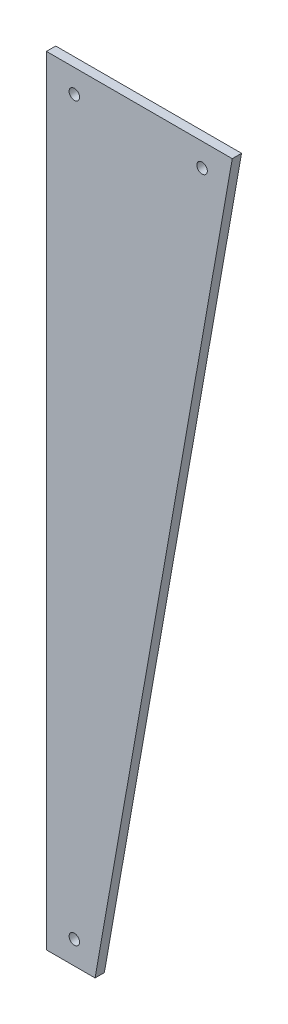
ISO-10303-21;
HEADER;
FILE_DESCRIPTION(('STEP AP214'),'2;1');
FILE_NAME('part.step','',(''),(''),'','','');
FILE_SCHEMA(('AUTOMOTIVE_DESIGN { 1 0 10303 214 1 1 1 1 }'));
ENDSEC;
DATA;
#1=APPLICATION_CONTEXT('core data for automotive mechanical design processes');
#2=APPLICATION_PROTOCOL_DEFINITION('international standard','automotive_design',2000,#1);
#3=PRODUCT_CONTEXT('',#1,'mechanical');
#4=PRODUCT('Part','Part','',(#3));
#5=PRODUCT_RELATED_PRODUCT_CATEGORY('part','',(#4));
#6=PRODUCT_DEFINITION_FORMATION('','',#4);
#7=PRODUCT_DEFINITION_CONTEXT('part definition',#1,'design');
#8=PRODUCT_DEFINITION('design','',#6,#7);
#9=PRODUCT_DEFINITION_SHAPE('','',#8);
#10=(LENGTH_UNIT() NAMED_UNIT(*) SI_UNIT(.MILLI.,.METRE.));
#11=(NAMED_UNIT(*) PLANE_ANGLE_UNIT() SI_UNIT($,.RADIAN.));
#12=(NAMED_UNIT(*) SI_UNIT($,.STERADIAN.) SOLID_ANGLE_UNIT());
#13=UNCERTAINTY_MEASURE_WITH_UNIT(LENGTH_MEASURE(1.E-05),#10,'distance_accuracy_value','');
#14=(GEOMETRIC_REPRESENTATION_CONTEXT(3) GLOBAL_UNCERTAINTY_ASSIGNED_CONTEXT((#13)) GLOBAL_UNIT_ASSIGNED_CONTEXT((#10,
#11,#12)) REPRESENTATION_CONTEXT('',''));
#15=CARTESIAN_POINT('',(0.,0.,0.));
#16=DIRECTION('',(0.,0.,1.));
#17=DIRECTION('',(1.,0.,0.));
#18=AXIS2_PLACEMENT_3D('',#15,#16,#17);
#19=CARTESIAN_POINT('',(0.,0.,4.));
#20=DIRECTION('',(0.,0.,1.));
#21=DIRECTION('',(1.,0.,0.));
#22=AXIS2_PLACEMENT_3D('',#19,#20,#21);
#23=PLANE('',#22);
#24=CARTESIAN_POINT('',(67.,-10.,4.));
#25=DIRECTION('',(0.,0.,1.));
#26=DIRECTION('',(1.,0.,0.));
#27=AXIS2_PLACEMENT_3D('',#24,#25,#26);
#28=CIRCLE('',#27,2.25);
#29=CARTESIAN_POINT('',(69.25,-10.,4.));
#30=VERTEX_POINT('',#29);
#31=EDGE_CURVE('E114',#30,#30,#28,.T.);
#32=ORIENTED_EDGE('',*,*,#31,.F.);
#33=EDGE_LOOP('',(#32));
#34=FACE_BOUND('',#33,.T.);
#35=DIRECTION('',(0.,-1.,0.));
#36=VECTOR('',#35,1.);
#37=CARTESIAN_POINT('',(0.,0.,4.));
#38=LINE('',#37,#36);
#39=CARTESIAN_POINT('',(0.,0.,4.));
#40=VERTEX_POINT('',#39);
#41=CARTESIAN_POINT('',(0.,-335.,4.));
#42=VERTEX_POINT('',#41);
#43=EDGE_CURVE('E84',#40,#42,#38,.T.);
#44=ORIENTED_EDGE('',*,*,#43,.T.);
#45=DIRECTION('',(1.,0.,0.));
#46=VECTOR('',#45,1.);
#47=CARTESIAN_POINT('',(0.,-335.,4.));
#48=LINE('',#47,#46);
#49=CARTESIAN_POINT('',(20.9304614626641,-335.,4.));
#50=VERTEX_POINT('',#49);
#51=EDGE_CURVE('E79',#42,#50,#48,.T.);
#52=ORIENTED_EDGE('',*,*,#51,.T.);
#53=DIRECTION('',(0.173648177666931,0.984807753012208,0.));
#54=VECTOR('',#53,1.);
#55=CARTESIAN_POINT('',(80.,0.,4.));
#56=LINE('',#55,#54);
#57=CARTESIAN_POINT('',(80.,0.,4.));
#58=VERTEX_POINT('',#57);
#59=EDGE_CURVE('E82',#50,#58,#56,.T.);
#60=ORIENTED_EDGE('',*,*,#59,.T.);
#61=DIRECTION('',(-1.,0.,0.));
#62=VECTOR('',#61,1.);
#63=CARTESIAN_POINT('',(0.,0.,4.));
#64=LINE('',#63,#62);
#65=EDGE_CURVE('E49',#58,#40,#64,.T.);
#66=ORIENTED_EDGE('',*,*,#65,.T.);
#67=EDGE_LOOP('',(#44,#52,#60,#66));
#68=FACE_BOUND('',#67,.T.);
#69=CARTESIAN_POINT('',(12.,-325.,4.));
#70=DIRECTION('',(0.,0.,1.));
#71=DIRECTION('',(1.,0.,0.));
#72=AXIS2_PLACEMENT_3D('',#69,#70,#71);
#73=CIRCLE('',#72,2.25);
#74=CARTESIAN_POINT('',(14.25,-325.,4.));
#75=VERTEX_POINT('',#74);
#76=EDGE_CURVE('E99',#75,#75,#73,.T.);
#77=ORIENTED_EDGE('',*,*,#76,.F.);
#78=EDGE_LOOP('',(#77));
#79=FACE_BOUND('',#78,.T.);
#80=CARTESIAN_POINT('',(12.,-10.,4.));
#81=DIRECTION('',(0.,0.,1.));
#82=DIRECTION('',(1.,0.,0.));
#83=AXIS2_PLACEMENT_3D('',#80,#81,#82);
#84=CIRCLE('',#83,2.25);
#85=CARTESIAN_POINT('',(14.25,-10.,4.));
#86=VERTEX_POINT('',#85);
#87=EDGE_CURVE('E120',#86,#86,#84,.T.);
#88=ORIENTED_EDGE('',*,*,#87,.F.);
#89=EDGE_LOOP('',(#88));
#90=FACE_BOUND('',#89,.T.);
#91=ADVANCED_FACE('F32',(#34,#68,#79,#90),#23,.T.);
#92=CARTESIAN_POINT('',(0.,0.,0.));
#93=DIRECTION('',(0.,0.,1.));
#94=DIRECTION('',(1.,0.,0.));
#95=AXIS2_PLACEMENT_3D('',#92,#93,#94);
#96=PLANE('',#95);
#97=CARTESIAN_POINT('',(67.,-10.,0.));
#98=DIRECTION('',(0.,0.,1.));
#99=DIRECTION('',(1.,0.,0.));
#100=AXIS2_PLACEMENT_3D('',#97,#98,#99);
#101=CIRCLE('',#100,2.25);
#102=CARTESIAN_POINT('',(69.25,-10.,0.));
#103=VERTEX_POINT('',#102);
#104=EDGE_CURVE('E117',#103,#103,#101,.T.);
#105=ORIENTED_EDGE('',*,*,#104,.T.);
#106=EDGE_LOOP('',(#105));
#107=FACE_BOUND('',#106,.T.);
#108=DIRECTION('',(0.,-1.,0.));
#109=VECTOR('',#108,1.);
#110=CARTESIAN_POINT('',(0.,0.,0.));
#111=LINE('',#110,#109);
#112=CARTESIAN_POINT('',(0.,0.,0.));
#113=VERTEX_POINT('',#112);
#114=CARTESIAN_POINT('',(0.,-335.,0.));
#115=VERTEX_POINT('',#114);
#116=EDGE_CURVE('E96',#113,#115,#111,.T.);
#117=ORIENTED_EDGE('',*,*,#116,.F.);
#118=DIRECTION('',(-1.,0.,0.));
#119=VECTOR('',#118,1.);
#120=CARTESIAN_POINT('',(0.,0.,0.));
#121=LINE('',#120,#119);
#122=CARTESIAN_POINT('',(80.,0.,0.));
#123=VERTEX_POINT('',#122);
#124=EDGE_CURVE('E72',#123,#113,#121,.T.);
#125=ORIENTED_EDGE('',*,*,#124,.F.);
#126=DIRECTION('',(0.173648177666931,0.984807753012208,0.));
#127=VECTOR('',#126,1.);
#128=CARTESIAN_POINT('',(80.,0.,0.));
#129=LINE('',#128,#127);
#130=CARTESIAN_POINT('',(20.9304614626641,-335.,0.));
#131=VERTEX_POINT('',#130);
#132=EDGE_CURVE('E66',#131,#123,#129,.T.);
#133=ORIENTED_EDGE('',*,*,#132,.F.);
#134=DIRECTION('',(1.,0.,0.));
#135=VECTOR('',#134,1.);
#136=CARTESIAN_POINT('',(0.,-335.,0.));
#137=LINE('',#136,#135);
#138=EDGE_CURVE('E88',#115,#131,#137,.T.);
#139=ORIENTED_EDGE('',*,*,#138,.F.);
#140=EDGE_LOOP('',(#117,#125,#133,#139));
#141=FACE_BOUND('',#140,.T.);
#142=CARTESIAN_POINT('',(12.,-325.,0.));
#143=DIRECTION('',(0.,0.,1.));
#144=DIRECTION('',(1.,0.,0.));
#145=AXIS2_PLACEMENT_3D('',#142,#143,#144);
#146=CIRCLE('',#145,2.25);
#147=CARTESIAN_POINT('',(14.25,-325.,0.));
#148=VERTEX_POINT('',#147);
#149=EDGE_CURVE('E111',#148,#148,#146,.T.);
#150=ORIENTED_EDGE('',*,*,#149,.T.);
#151=EDGE_LOOP('',(#150));
#152=FACE_BOUND('',#151,.T.);
#153=CARTESIAN_POINT('',(12.,-10.,0.));
#154=DIRECTION('',(0.,0.,1.));
#155=DIRECTION('',(1.,0.,0.));
#156=AXIS2_PLACEMENT_3D('',#153,#154,#155);
#157=CIRCLE('',#156,2.25);
#158=CARTESIAN_POINT('',(14.25,-10.,0.));
#159=VERTEX_POINT('',#158);
#160=EDGE_CURVE('E123',#159,#159,#157,.T.);
#161=ORIENTED_EDGE('',*,*,#160,.T.);
#162=EDGE_LOOP('',(#161));
#163=FACE_BOUND('',#162,.T.);
#164=ADVANCED_FACE('F107',(#107,#141,#152,#163),#96,.F.);
#165=CARTESIAN_POINT('',(0.,0.,4.));
#166=DIRECTION('',(1.,0.,0.));
#167=DIRECTION('',(0.,1.,0.));
#168=AXIS2_PLACEMENT_3D('',#165,#166,#167);
#169=PLANE('',#168);
#170=ORIENTED_EDGE('',*,*,#116,.T.);
#171=DIRECTION('',(0.,0.,-1.));
#172=VECTOR('',#171,1.);
#173=CARTESIAN_POINT('',(0.,-335.,4.));
#174=LINE('',#173,#172);
#175=EDGE_CURVE('E11',#42,#115,#174,.T.);
#176=ORIENTED_EDGE('',*,*,#175,.F.);
#177=ORIENTED_EDGE('',*,*,#43,.F.);
#178=DIRECTION('',(0.,0.,-1.));
#179=VECTOR('',#178,1.);
#180=CARTESIAN_POINT('',(0.,0.,4.));
#181=LINE('',#180,#179);
#182=EDGE_CURVE('E92',#40,#113,#181,.T.);
#183=ORIENTED_EDGE('',*,*,#182,.T.);
#184=EDGE_LOOP('',(#170,#176,#177,#183));
#185=FACE_BOUND('',#184,.T.);
#186=ADVANCED_FACE('F34',(#185),#169,.F.);
#187=CARTESIAN_POINT('',(0.,-335.,4.));
#188=DIRECTION('',(0.,1.,0.));
#189=DIRECTION('',(0.,0.,1.));
#190=AXIS2_PLACEMENT_3D('',#187,#188,#189);
#191=PLANE('',#190);
#192=ORIENTED_EDGE('',*,*,#138,.T.);
#193=DIRECTION('',(0.,0.,-1.));
#194=VECTOR('',#193,1.);
#195=CARTESIAN_POINT('',(20.9304614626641,-335.,4.));
#196=LINE('',#195,#194);
#197=EDGE_CURVE('E41',#50,#131,#196,.T.);
#198=ORIENTED_EDGE('',*,*,#197,.F.);
#199=ORIENTED_EDGE('',*,*,#51,.F.);
#200=ORIENTED_EDGE('',*,*,#175,.T.);
#201=EDGE_LOOP('',(#192,#198,#199,#200));
#202=FACE_BOUND('',#201,.T.);
#203=ADVANCED_FACE('F87',(#202),#191,.F.);
#204=CARTESIAN_POINT('',(80.,0.,4.));
#205=DIRECTION('',(-0.984807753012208,0.173648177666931,0.));
#206=DIRECTION('',(-0.173648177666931,-0.984807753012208,0.));
#207=AXIS2_PLACEMENT_3D('',#204,#205,#206);
#208=PLANE('',#207);
#209=ORIENTED_EDGE('',*,*,#132,.T.);
#210=DIRECTION('',(0.,0.,-1.));
#211=VECTOR('',#210,1.);
#212=CARTESIAN_POINT('',(80.,0.,4.));
#213=LINE('',#212,#211);
#214=EDGE_CURVE('E89',#58,#123,#213,.T.);
#215=ORIENTED_EDGE('',*,*,#214,.F.);
#216=ORIENTED_EDGE('',*,*,#59,.F.);
#217=ORIENTED_EDGE('',*,*,#197,.T.);
#218=EDGE_LOOP('',(#209,#215,#216,#217));
#219=FACE_BOUND('',#218,.T.);
#220=ADVANCED_FACE('F90',(#219),#208,.F.);
#221=CARTESIAN_POINT('',(0.,0.,4.));
#222=DIRECTION('',(0.,-1.,0.));
#223=DIRECTION('',(0.,0.,-1.));
#224=AXIS2_PLACEMENT_3D('',#221,#222,#223);
#225=PLANE('',#224);
#226=ORIENTED_EDGE('',*,*,#124,.T.);
#227=ORIENTED_EDGE('',*,*,#182,.F.);
#228=ORIENTED_EDGE('',*,*,#65,.F.);
#229=ORIENTED_EDGE('',*,*,#214,.T.);
#230=EDGE_LOOP('',(#226,#227,#228,#229));
#231=FACE_BOUND('',#230,.T.);
#232=ADVANCED_FACE('F104',(#231),#225,.F.);
#233=CARTESIAN_POINT('',(12.,-325.,4.));
#234=DIRECTION('',(0.,0.,-1.));
#235=DIRECTION('',(-1.,0.,0.));
#236=AXIS2_PLACEMENT_3D('',#233,#234,#235);
#237=CYLINDRICAL_SURFACE('',#236,2.25);
#238=ORIENTED_EDGE('',*,*,#76,.T.);
#239=EDGE_LOOP('',(#238));
#240=FACE_BOUND('',#239,.T.);
#241=ORIENTED_EDGE('',*,*,#149,.F.);
#242=EDGE_LOOP('',(#241));
#243=FACE_BOUND('',#242,.T.);
#244=ADVANCED_FACE('F142',(#240,#243),#237,.F.);
#245=CARTESIAN_POINT('',(67.,-10.,4.));
#246=DIRECTION('',(0.,0.,-1.));
#247=DIRECTION('',(-1.,0.,0.));
#248=AXIS2_PLACEMENT_3D('',#245,#246,#247);
#249=CYLINDRICAL_SURFACE('',#248,2.25);
#250=ORIENTED_EDGE('',*,*,#31,.T.);
#251=EDGE_LOOP('',(#250));
#252=FACE_BOUND('',#251,.T.);
#253=ORIENTED_EDGE('',*,*,#104,.F.);
#254=EDGE_LOOP('',(#253));
#255=FACE_BOUND('',#254,.T.);
#256=ADVANCED_FACE('F188',(#252,#255),#249,.F.);
#257=CARTESIAN_POINT('',(12.,-10.,4.));
#258=DIRECTION('',(0.,0.,-1.));
#259=DIRECTION('',(-1.,0.,0.));
#260=AXIS2_PLACEMENT_3D('',#257,#258,#259);
#261=CYLINDRICAL_SURFACE('',#260,2.25);
#262=ORIENTED_EDGE('',*,*,#87,.T.);
#263=EDGE_LOOP('',(#262));
#264=FACE_BOUND('',#263,.T.);
#265=ORIENTED_EDGE('',*,*,#160,.F.);
#266=EDGE_LOOP('',(#265));
#267=FACE_BOUND('',#266,.T.);
#268=ADVANCED_FACE('F129',(#264,#267),#261,.F.);
#269=CLOSED_SHELL('',(#91,#164,#186,#203,#220,#232,#244,#256,#268));
#270=MANIFOLD_SOLID_BREP('B2',#269);
#271=ADVANCED_BREP_SHAPE_REPRESENTATION('',(#18,#270),#14);
#272=SHAPE_DEFINITION_REPRESENTATION(#9,#271);
ENDSEC;
END-ISO-10303-21;
